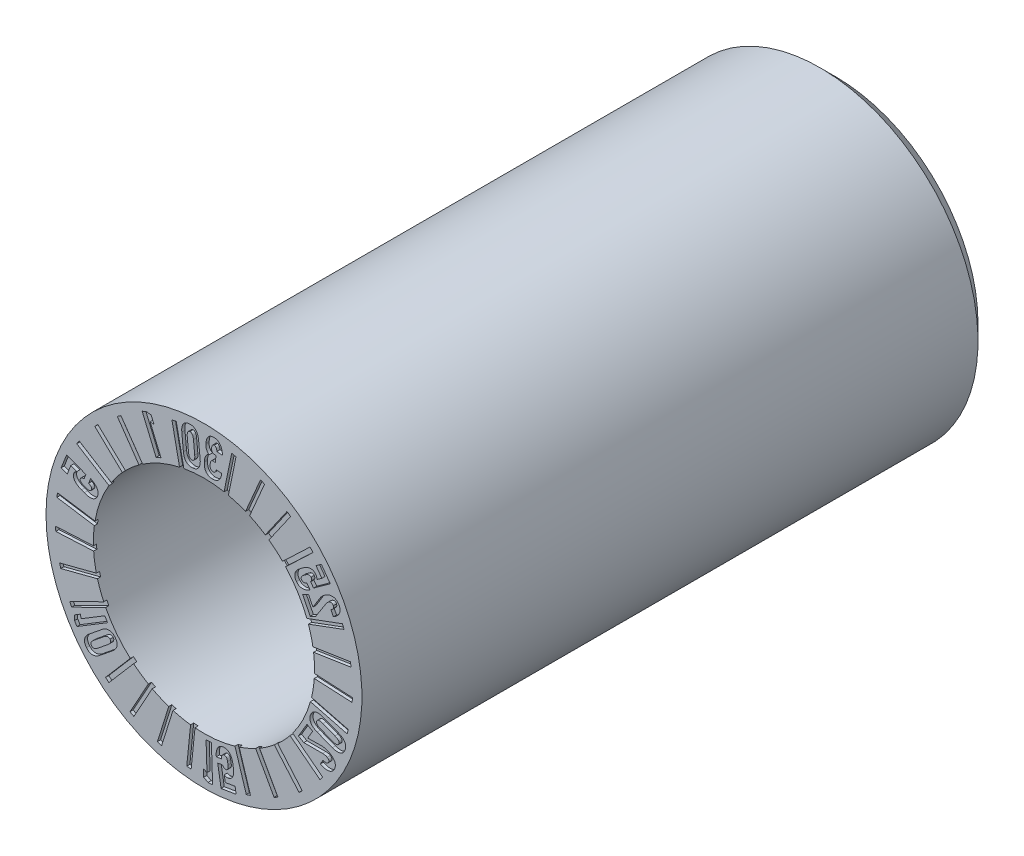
from build123d import *

# Parameters (mm, degrees)
CUT_EXTRUDE1_DEPTH = 0.1


with BuildPart() as part:
    # Sketch1 → Revolve1 (revolve)
    with BuildSketch(Plane(origin=(0, 0, 0), x_dir=(0, 0, -1), z_dir=(1, 0, 0)), mode=Mode.PRIVATE) as revolve1_sk:
        Polygon((20, 2.5), (20, 4.5), (19.5, 5), (0, 5), (0, 3.5), (5, 3.5), (5, 1.25), (15, 1.25), (15, 2.5), align=None)
    revolve(revolve1_sk.sketch.rotate(Axis((0, 0, 0), (0, 0, 1)), 90), axis=Axis((0, 0, 0), (0, 0, 1)))

    # Sketch2 → Cut-Extrude1 (cut)
    # profile 1 of 36: a face of its own
    with BuildSketch(Plane.XY):
        Polygon((1.01467014, 4.589699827), (0.71272236, 3.120404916), (0.575588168, 3.148586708), (0.877535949, 4.61788162), align=None)
    # profile 2 of 36: a face of its own
    with BuildSketch(Plane.XY):
        Polygon((1.917799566, 4.291496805), (1.326265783, 2.913060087), (1.19761169, 2.968269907), (1.789145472, 4.346706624), align=None)
    # profile 3 of 36: a face of its own
    with BuildSketch(Plane.XY):
        Polygon((2.742414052, 3.817599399), (1.885511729, 2.586454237), (1.770604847, 2.666431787), (2.62750717, 3.897576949), align=None)
    # profile 4 of 36: a face of its own
    with BuildSketch(Plane.XY):
        Polygon((3.454753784, 3.187409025), (2.367564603, 2.153958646), (2.271109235, 2.255429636), (3.358298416, 3.288880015), align=None)
    # profile 5 of 36: a face of its own
    with BuildSketch(Plane.XY):
        Polygon((4.431746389, 1.566692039), (3.025118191, 1.04573416), (2.976495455, 1.177019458), (4.383123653, 1.697977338), align=None)
    # profile 6 of 36: a face of its own
    with BuildSketch(Plane.XY):
        Polygon((4.656401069, 0.642517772), (3.173698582, 0.415376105), (3.152498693, 0.553761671), (4.63520118, 0.780903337), align=None)
    # profile 7 of 36: a face of its own
    with BuildSketch(Plane.XY):
        Polygon((4.690422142, -0.307961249), (3.192347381, -0.231987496), (3.199438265, -0.092167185), (4.697513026, -0.168140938), align=None)
    # profile 8 of 36: a face of its own
    with BuildSketch(Plane.XY):
        Polygon((4.532416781, -1.2458323), (3.080301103, -0.869853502), (3.115392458, -0.734322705), (4.567508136, -1.110301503), align=None)
    # profile 9 of 36: a face of its own
    with BuildSketch(Plane.XY):
        Polygon((3.673798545, -2.93225242), (2.487634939, -2.014093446), (2.573329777, -1.903384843), (3.759493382, -2.821543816), align=None)
    # profile 10 of 36: a face of its own
    with BuildSketch(Plane.XY):
        Polygon((3.0083376, -3.61175925), (2.031278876, -2.473622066), (2.137505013, -2.382429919), (3.114563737, -3.520567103), align=None)
    # profile 11 of 36: a face of its own
    with BuildSketch(Plane.XY):
        Polygon((2.219714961, -4.143400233), (1.491762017, -2.831880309), (1.614170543, -2.763938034), (2.342123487, -4.075457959), align=None)
    # profile 12 of 36: a face of its own
    with BuildSketch(Plane.XY):
        Polygon((1.34021693, -4.505409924), (0.891172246, -3.074201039), (1.024751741, -3.032290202), (1.473796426, -4.463499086), align=None)
    # profile 13 of 36: a face of its own
    with BuildSketch(Plane.XY):
        Polygon((-0.545131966, -4.668804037), (-0.393379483, -3.176500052), (-0.254097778, -3.190663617), (-0.405850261, -4.682967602), align=None)
    # profile 14 of 36: a face of its own
    with BuildSketch(Plane.XY):
        Polygon((-1.473796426, -4.463499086), (-1.024751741, -3.032290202), (-0.891172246, -3.074201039), (-1.34021693, -4.505409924), align=None)
    # profile 15 of 36: a face of its own
    with BuildSketch(Plane.XY):
        Polygon((-2.342123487, -4.075457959), (-1.614170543, -2.763938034), (-1.491762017, -2.831880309), (-2.219714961, -4.143400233), align=None)
    # profile 16 of 36: a face of its own
    with BuildSketch(Plane.XY):
        Polygon((-3.114563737, -3.520567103), (-2.137505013, -2.382429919), (-2.031278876, -2.473622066), (-3.0083376, -3.61175925), align=None)
    # profile 17 of 36: a face of its own
    with BuildSketch(Plane.XY):
        Polygon((-4.250508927, -2.007006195), (-2.903802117, -1.346414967), (-2.842146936, -1.472107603), (-4.188853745, -2.13269883), align=None)
    # profile 18 of 36: a face of its own
    with BuildSketch(Plane.XY):
        Polygon((-4.567508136, -1.110301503), (-3.115392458, -0.734322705), (-3.080301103, -0.869853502), (-4.532416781, -1.2458323), align=None)
    # profile 19 of 36: a face of its own
    with BuildSketch(Plane.XY):
        Polygon((-4.697513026, -0.168140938), (-3.199438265, -0.092167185), (-3.192347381, -0.231987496), (-4.690422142, -0.307961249), align=None)
    # profile 20 of 36: a face of its own
    with BuildSketch(Plane.XY):
        Polygon((-4.63520118, 0.780903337), (-3.152498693, 0.553761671), (-3.173698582, 0.415376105), (-4.656401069, 0.642517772), align=None)
    # profile 21 of 36: a face of its own
    with BuildSketch(Plane.XY):
        Polygon((-3.95160053, 2.545535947), (-2.678634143, 1.752089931), (-2.752689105, 1.633279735), (-4.025655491, 2.426725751), align=None)
    # profile 22 of 36: a face of its own
    with BuildSketch(Plane.XY):
        Polygon((-3.358298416, 3.288880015), (-2.271109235, 2.255429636), (-2.367564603, 2.153958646), (-3.454753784, 3.187409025), align=None)
    # profile 23 of 36: a face of its own
    with BuildSketch(Plane.XY):
        Polygon((-2.62750717, 3.897576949), (-1.770604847, 2.666431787), (-1.885511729, 2.586454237), (-2.742414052, 3.817599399), align=None)
    # profile 24 of 36: a face of its own
    with BuildSketch(Plane.XY):
        Polygon((-0.877535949, 4.61788162), (-0.575588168, 3.148586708), (-0.71272236, 3.120404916), (-1.01467014, 4.589699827), align=None)
    # profile 25 of 36: a face of its own
    with BuildSketch(Plane.XY):
        with BuildLine():
            Line((3.537106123, 1.478969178), (3.861617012, 1.985097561))
            add(Edge.make_bspline(
                [(3.861617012, 1.985097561), (3.869126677, 1.996025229), (3.883959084, 2.017608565), (3.90992891, 2.045935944), (3.937353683, 2.069550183), (3.957432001, 2.081034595), (3.966924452, 2.086464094)],
                knots=[0, 0, 0, 0, 1.075777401, 2.124777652, 3.113448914, 4, 4, 4, 4], degree=3))
            Line((3.966924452, 2.086464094), (3.968318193, 2.087161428))
            add(Edge.make_bspline(
                [(3.968318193, 2.087161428), (3.975010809, 2.090259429), (3.987655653, 2.096112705), (4.007191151, 2.100725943), (4.025616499, 2.10191601), (4.042979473, 2.098956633), (4.05911621, 2.092401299), (4.073174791, 2.081484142), (4.085778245, 2.067416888), (4.092007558, 2.056030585), (4.095268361, 2.050070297)],
                knots=[0, 0, 0, 0, 1.174484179, 2.219038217, 3.184458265, 4.102169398, 5.007560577, 5.934630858, 6.918859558, 8, 8, 8, 8], degree=3))
            add(Edge.make_bspline(
                [(4.095268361, 2.050070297), (4.097954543, 2.043868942), (4.103179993, 2.031805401), (4.10512018, 2.012073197), (4.102254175, 1.992396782), (4.094381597, 1.97286076), (4.082118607, 1.953546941), (4.065220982, 1.934916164), (4.044021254, 1.91686602), (4.027669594, 1.906315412), (4.019060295, 1.900760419)],
                knots=[0, 0, 0, 0, 0.871270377, 1.694888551, 2.530222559, 3.426223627, 4.402940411, 5.480495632, 6.673457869, 8, 8, 8, 8], degree=3))
            Line((4.019060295, 1.900760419), (4.095721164, 1.745450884))
            add(Edge.make_bspline(
                [(4.095721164, 1.745450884), (4.11142617, 1.754543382), (4.140334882, 1.771625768), (4.179544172, 1.800837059), (4.214027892, 1.831312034), (4.243402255, 1.863323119), (4.267527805, 1.896583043), (4.286558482, 1.930509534), (4.299817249, 1.965403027), (4.307389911, 2.000865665), (4.309738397, 2.036650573), (4.306275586, 2.072398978), (4.296986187, 2.107906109), (4.286902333, 2.130459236), (4.28175134, 2.141979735)],
                knots=[0, 0, 0, 0, 1.278907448, 2.478786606, 3.605086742, 4.67400219, 5.680892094, 6.633839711, 7.538995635, 8.427109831, 9.3028697, 10.177470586, 11.069022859, 12, 12, 12, 12], degree=3))
            add(Edge.make_bspline(
                [(4.28175134, 2.141979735), (4.275314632, 2.153852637), (4.262859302, 2.176827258), (4.240166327, 2.20770025), (4.214826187, 2.233863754), (4.186839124, 2.255156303), (4.156704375, 2.271668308), (4.124380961, 2.283223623), (4.090019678, 2.289590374), (4.053839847, 2.290767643), (4.016096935, 2.287159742), (3.97703998, 2.278295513), (3.936426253, 2.264976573), (3.909910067, 2.252328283), (3.896163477, 2.245771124)],
                knots=[0, 0, 0, 0, 1.071364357, 2.073140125, 3.031460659, 3.953777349, 4.85463199, 5.749254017, 6.66768898, 7.61770878, 8.614490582, 9.669551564, 10.791842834, 12, 12, 12, 12], degree=3))
            add(Edge.make_bspline(
                [(3.896163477, 2.245771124), (3.883875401, 2.239500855), (3.860853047, 2.227504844), (3.828023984, 2.206263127), (3.796295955, 2.183065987), (3.766241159, 2.15754336), (3.738183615, 2.130462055), (3.712233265, 2.102220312), (3.688855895, 2.072846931), (3.675321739, 2.052051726), (3.668635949, 2.041779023)],
                knots=[0, 0, 0, 0, 1.008240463, 2.018746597, 3.038460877, 4.064474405, 5.083707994, 6.070496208, 7.046837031, 8, 8, 8, 8], degree=3))
            Line((3.668635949, 2.041779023), (3.448862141, 1.68506104))
            Line((3.448862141, 1.68506104), (3.31185902, 1.959349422))
            Line((3.31185902, 1.959349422), (3.125840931, 1.866510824))
            Line((3.125840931, 1.866510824), (3.363027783, 1.391988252))
            Line((3.363027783, 1.391988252), (3.537106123, 1.478969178))
        make_face()
    # profile 26 of 36: a face of its own
    with BuildSketch(Plane.XY):
        with BuildLine():
            add(Edge.make_bspline(
                [(2.925964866, 2.126838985), (2.933280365, 2.117615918), (2.947740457, 2.099385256), (2.973836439, 2.076383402), (3.003098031, 2.05803202), (3.035041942, 2.043897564), (3.069606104, 2.034592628), (3.106388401, 2.030718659), (3.145037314, 2.031751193), (3.185466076, 2.037780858), (3.227172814, 2.049049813), (3.269915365, 2.065086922), (3.313331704, 2.08625383), (3.341500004, 2.103582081), (3.355994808, 2.112498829)],
                knots=[0, 0, 0, 0, 0.885991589, 1.75128449, 2.606338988, 3.48042636, 4.374685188, 5.292761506, 6.258245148, 7.28149435, 8.366223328, 9.508414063, 10.717883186, 12, 12, 12, 12], degree=3))
            Line((3.355994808, 2.112498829), (3.257073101, 2.250550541))
            add(Edge.make_bspline(
                [(3.257073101, 2.250550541), (3.247787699, 2.245016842), (3.2314128, 2.235498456), (3.206388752, 2.225097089), (3.182661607, 2.218877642), (3.16035998, 2.216550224), (3.139713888, 2.218651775), (3.121261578, 2.225049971), (3.105097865, 2.235832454), (3.096930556, 2.245748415), (3.092723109, 2.250856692)],
                knots=[0, 0, 0, 0, 1.321316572, 2.507806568, 3.578164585, 4.561779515, 5.46339896, 6.305099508, 7.126859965, 8, 8, 8, 8], degree=3))
            add(Edge.make_bspline(
                [(3.092723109, 2.250856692), (3.088917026, 2.256794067), (3.081534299, 2.268310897), (3.076238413, 2.28806678), (3.075952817, 2.308402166), (3.081579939, 2.329052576), (3.091861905, 2.349867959), (3.107580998, 2.370097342), (3.127424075, 2.390546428), (3.143398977, 2.402607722), (3.151844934, 2.408984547)],
                knots=[0, 0, 0, 0, 0.888030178, 1.722527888, 2.550032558, 3.434051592, 4.404269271, 5.47042815, 6.66261131, 8, 8, 8, 8], degree=3))
            Line((3.151844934, 2.408984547), (3.22868963, 2.464815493))
            add(Edge.make_bspline(
                [(3.22868963, 2.464815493), (3.237385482, 2.470864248), (3.25377586, 2.482265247), (3.278933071, 2.49521709), (3.302428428, 2.504131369), (3.324521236, 2.508501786), (3.34490082, 2.508333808), (3.363113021, 2.503217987), (3.379148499, 2.493636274), (3.38695073, 2.48404382), (3.390959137, 2.479115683)],
                knots=[0, 0, 0, 0, 1.39525182, 2.629840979, 3.72056481, 4.698400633, 5.583454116, 6.380437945, 7.167947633, 8, 8, 8, 8], degree=3))
            add(Edge.make_bspline(
                [(3.390959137, 2.479115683), (3.394173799, 2.474245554), (3.400520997, 2.464629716), (3.406554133, 2.44857792), (3.409399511, 2.43187959), (3.408870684, 2.414779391), (3.405514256, 2.397527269), (3.39870942, 2.380482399), (3.389442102, 2.363391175), (3.380890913, 2.353064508), (3.376475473, 2.347732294)],
                knots=[0, 0, 0, 0, 0.973030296, 1.921202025, 2.841845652, 3.787894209, 4.765734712, 5.763843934, 6.845352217, 8, 8, 8, 8], degree=3))
            Line((3.376475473, 2.347732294), (3.469528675, 2.219412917))
            Line((3.469528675, 2.219412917), (3.997867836, 2.602598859))
            Line((3.997867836, 2.602598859), (3.713963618, 2.993990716))
            Line((3.713963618, 2.993990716), (3.547185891, 2.8729116))
            Line((3.547185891, 2.8729116), (3.731438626, 2.618831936))
            Line((3.731438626, 2.618831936), (3.569193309, 2.501162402))
            add(Edge.make_bspline(
                [(3.569193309, 2.501162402), (3.570235, 2.506144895), (3.572347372, 2.516248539), (3.572858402, 2.532132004), (3.571709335, 2.548620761), (3.568307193, 2.565502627), (3.56348463, 2.582109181), (3.557256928, 2.598056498), (3.549830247, 2.613016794), (3.543547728, 2.6221096), (3.540443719, 2.62660209)],
                knots=[0, 0, 0, 0, 0.921008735, 1.867648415, 2.868505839, 3.911388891, 4.981955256, 5.999114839, 7.01142107, 8, 8, 8, 8], degree=3))
            add(Edge.make_bspline(
                [(3.540443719, 2.62660209), (3.53346811, 2.635534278), (3.519889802, 2.652921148), (3.494718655, 2.673768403), (3.46739984, 2.690152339), (3.437135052, 2.700724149), (3.40479823, 2.70660837), (3.370242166, 2.707068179), (3.333835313, 2.701952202), (3.295540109, 2.692024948), (3.255695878, 2.676845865), (3.214224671, 2.657059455), (3.171562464, 2.631898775), (3.143557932, 2.612292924), (3.129038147, 2.602127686)],
                knots=[0, 0, 0, 0, 0.879918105, 1.712796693, 2.527522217, 3.347738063, 4.193476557, 5.076363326, 6.025485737, 7.047293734, 8.149764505, 9.339436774, 10.62055163, 12, 12, 12, 12], degree=3))
            Line((3.129038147, 2.602127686), (3.05219345, 2.54629674))
            add(Edge.make_bspline(
                [(3.05219345, 2.54629674), (3.0379867, 2.535646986), (3.01059512, 2.515113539), (2.974497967, 2.48104327), (2.943002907, 2.447046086), (2.917845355, 2.411693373), (2.898042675, 2.375994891), (2.884303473, 2.339921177), (2.875939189, 2.303616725), (2.873992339, 2.267235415), (2.877684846, 2.230905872), (2.887946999, 2.195299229), (2.903653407, 2.159916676), (2.918355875, 2.138119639), (2.925964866, 2.126838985)],
                knots=[0, 0, 0, 0, 1.289634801, 2.486503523, 3.602778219, 4.653209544, 5.63252728, 6.562450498, 7.450272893, 8.329613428, 9.198969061, 10.092022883, 11.012561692, 12, 12, 12, 12], degree=3))
        make_face()
    # profile 27 of 36: a face of its own
    with BuildSketch(Plane.XY):
        with BuildLine():
            add(Edge.make_bspline(
                [(0.253969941, 3.608582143), (0.267250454, 3.60811704), (0.293252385, 3.607206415), (0.331475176, 3.611619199), (0.367743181, 3.621061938), (0.401893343, 3.635309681), (0.433670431, 3.65428924), (0.462549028, 3.678047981), (0.488328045, 3.706460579), (0.511289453, 3.7390369), (0.530301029, 3.775977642), (0.545892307, 3.816565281), (0.557195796, 3.860973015), (0.561335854, 3.892022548), (0.563466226, 3.907999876)],
                knots=[0, 0, 0, 0, 0.991673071, 1.941597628, 2.862324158, 3.783050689, 4.696478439, 5.617622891, 6.565995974, 7.554356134, 8.586381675, 9.661310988, 10.796567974, 12, 12, 12, 12], degree=3))
            Line((0.563466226, 3.907999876), (0.388761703, 3.920095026))
            add(Edge.make_bspline(
                [(0.388761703, 3.920095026), (0.387573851, 3.914469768), (0.385270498, 3.903561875), (0.380918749, 3.887946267), (0.375109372, 3.873857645), (0.366588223, 3.857429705), (0.353345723, 3.840258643), (0.337003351, 3.827421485), (0.322742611, 3.820236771), (0.311185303, 3.817510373), (0.29921021, 3.815196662), (0.291002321, 3.815611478), (0.286773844, 3.81582518)],
                knots=[0, 0, 0, 0, 1.071089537, 2.076941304, 3.014685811, 3.904600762, 5.520471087, 7.010002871, 7.738236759, 8.475136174, 9.214432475, 10, 10, 10, 10], degree=3))
            add(Edge.make_bspline(
                [(0.286773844, 3.81582518), (0.2792253, 3.816792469), (0.264711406, 3.818652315), (0.244514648, 3.826369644), (0.227608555, 3.83873398), (0.213958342, 3.855010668), (0.203729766, 3.874994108), (0.19685458, 3.898179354), (0.194127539, 3.924651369), (0.194777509, 3.943125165), (0.195120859, 3.95288404)],
                knots=[0, 0, 0, 0, 0.977717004, 1.87989668, 2.749810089, 3.64668343, 4.590292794, 5.621084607, 6.743326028, 8, 8, 8, 8], degree=3))
            Line((0.195120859, 3.95288404), (0.1969595, 3.979602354))
            add(Edge.make_bspline(
                [(0.1969595, 3.979602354), (0.197841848, 3.9897971), (0.199514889, 4.009127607), (0.205210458, 4.036020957), (0.213563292, 4.059027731), (0.223973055, 4.078224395), (0.236917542, 4.093319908), (0.252192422, 4.103953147), (0.269723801, 4.109894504), (0.281976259, 4.109802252), (0.288238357, 4.109755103)],
                knots=[0, 0, 0, 0, 1.380249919, 2.617125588, 3.69749369, 4.673757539, 5.549203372, 6.355606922, 7.159568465, 8, 8, 8, 8], degree=3))
            Line((0.288238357, 4.109755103), (0.364187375, 4.104354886))
            Line((0.364187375, 4.104354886), (0.37819874, 4.311396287))
            Line((0.37819874, 4.311396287), (0.302249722, 4.316796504))
            add(Edge.make_bspline(
                [(0.302249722, 4.316796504), (0.297145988, 4.317509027), (0.287208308, 4.318896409), (0.273733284, 4.32606611), (0.262664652, 4.336938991), (0.254120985, 4.351496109), (0.247795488, 4.369195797), (0.243715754, 4.38983963), (0.242112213, 4.413397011), (0.242830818, 4.429960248), (0.243212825, 4.438765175)],
                knots=[0, 0, 0, 0, 0.815235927, 1.587377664, 2.381454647, 3.257625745, 4.250509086, 5.361869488, 6.597584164, 8, 8, 8, 8], degree=3))
            Line((0.243212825, 4.438765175), (0.244551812, 4.458516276))
            add(Edge.make_bspline(
                [(0.244551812, 4.458516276), (0.245346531, 4.46677295), (0.246849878, 4.482391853), (0.251916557, 4.504094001), (0.259086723, 4.522808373), (0.268668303, 4.538251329), (0.280348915, 4.550434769), (0.293948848, 4.558973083), (0.309565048, 4.563401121), (0.320360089, 4.56333502), (0.325970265, 4.563300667)],
                knots=[0, 0, 0, 0, 1.333788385, 2.523087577, 3.575023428, 4.545628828, 5.428050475, 6.269011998, 7.100406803, 8, 8, 8, 8], degree=3))
            add(Edge.make_bspline(
                [(0.325970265, 4.563300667), (0.329733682, 4.562802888), (0.337158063, 4.56182088), (0.348029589, 4.55856717), (0.357793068, 4.552628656), (0.367251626, 4.545601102), (0.37557423, 4.536441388), (0.383397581, 4.525967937), (0.390042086, 4.513666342), (0.395889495, 4.499890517), (0.400703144, 4.484649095), (0.404862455, 4.467994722), (0.407574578, 4.449820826), (0.408731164, 4.43718823), (0.409327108, 4.430679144)],
                knots=[0, 0, 0, 0, 0.800989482, 1.580173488, 2.372276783, 3.199352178, 4.059514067, 4.972548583, 5.953147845, 7.001416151, 8.127090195, 9.322836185, 10.620561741, 12, 12, 12, 12], degree=3))
            Line((0.409327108, 4.430679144), (0.583373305, 4.418910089))
            add(Edge.make_bspline(
                [(0.583373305, 4.418910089), (0.582992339, 4.435838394), (0.582253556, 4.468666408), (0.575953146, 4.516195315), (0.566372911, 4.560476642), (0.552534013, 4.601239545), (0.535136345, 4.638247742), (0.514783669, 4.671342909), (0.490866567, 4.699917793), (0.464172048, 4.724098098), (0.434857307, 4.743978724), (0.403032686, 4.75828939), (0.369396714, 4.768584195), (0.34604273, 4.771063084), (0.334158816, 4.772324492)],
                knots=[0, 0, 0, 0, 1.27230578, 2.467303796, 3.59858345, 4.674031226, 5.696322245, 6.667733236, 7.586997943, 8.48816013, 9.368367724, 10.23784044, 11.103307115, 12, 12, 12, 12], degree=3))
            add(Edge.make_bspline(
                [(0.334158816, 4.772324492), (0.324496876, 4.772770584), (0.305663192, 4.773640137), (0.278037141, 4.771612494), (0.251803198, 4.767822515), (0.227262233, 4.76066892), (0.204081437, 4.751529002), (0.182701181, 4.739301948), (0.162645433, 4.724884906), (0.14435231, 4.707798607), (0.127529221, 4.688600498), (0.112838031, 4.666952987), (0.099793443, 4.643285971), (0.089091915, 4.617282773), (0.079996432, 4.589221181), (0.072801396, 4.559090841), (0.0676312, 4.526725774), (0.065721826, 4.504409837), (0.064737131, 4.492901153)],
                knots=[0, 0, 0, 0, 1.052085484, 2.050793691, 3.010965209, 3.932068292, 4.827223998, 5.717562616, 6.606023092, 7.51065746, 8.436686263, 9.379300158, 10.353253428, 11.373717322, 12.435487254, 13.562153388, 14.742763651, 16, 16, 16, 16], degree=3))
            Line((0.064737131, 4.492901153), (0.062302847, 4.458525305))
            add(Edge.make_bspline(
                [(0.062302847, 4.458525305), (0.061802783, 4.445731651), (0.060826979, 4.420766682), (0.064165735, 4.384228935), (0.072005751, 4.35004398), (0.083406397, 4.3182551), (0.098920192, 4.289428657), (0.118233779, 4.263914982), (0.140971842, 4.241616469), (0.158744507, 4.230104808), (0.167658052, 4.224331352)],
                knots=[0, 0, 0, 0, 1.133679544, 2.212212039, 3.239405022, 4.233969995, 5.196048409, 6.127643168, 7.060954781, 8, 8, 8, 8], degree=3))
            add(Edge.make_bspline(
                [(0.167658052, 4.224331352), (0.16225609, 4.223019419), (0.151489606, 4.220404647), (0.13620253, 4.214178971), (0.121555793, 4.206783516), (0.107782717, 4.197650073), (0.095106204, 4.186613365), (0.08290023, 4.174369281), (0.071628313, 4.160451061), (0.057593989, 4.139366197), (0.042396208, 4.109485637), (0.028465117, 4.069234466), (0.018702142, 4.024124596), (0.015871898, 3.992270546), (0.014396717, 3.975667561)],
                knots=[0, 0, 0, 0, 0.637174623, 1.269933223, 1.888808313, 2.518375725, 3.160489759, 3.814608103, 4.500497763, 5.211993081, 6.718565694, 8.332560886, 10.088455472, 12, 12, 12, 12], degree=3))
            Line((0.014396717, 3.975667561), (0.011962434, 3.941291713))
            add(Edge.make_bspline(
                [(0.011962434, 3.941291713), (0.011240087, 3.925248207), (0.009845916, 3.894283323), (0.012520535, 3.849250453), (0.019339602, 3.807564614), (0.030029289, 3.769224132), (0.045139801, 3.73468592), (0.0638103, 3.703715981), (0.08700707, 3.677119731), (0.113671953, 3.654381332), (0.143996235, 3.63601754), (0.177767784, 3.622265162), (0.214683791, 3.612493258), (0.24061989, 3.609911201), (0.253969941, 3.608582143)],
                knots=[0, 0, 0, 0, 1.238278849, 2.389949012, 3.472617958, 4.491643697, 5.451665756, 6.372602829, 7.270087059, 8.161706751, 9.066142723, 9.992026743, 10.966438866, 12, 12, 12, 12], degree=3))
        make_face()
    # profile 28 of 36: a face of its own
    with BuildSketch(Plane.XY):
        with BuildLine():
            add(Edge.make_bspline(
                [(-0.35407824, 3.599473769), (-0.343590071, 3.600706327), (-0.323163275, 3.60310686), (-0.293921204, 3.610395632), (-0.266682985, 3.619360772), (-0.241701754, 3.631326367), (-0.21907307, 3.645863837), (-0.198355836, 3.662525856), (-0.180360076, 3.682114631), (-0.164270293, 3.703767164), (-0.150606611, 3.727750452), (-0.139077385, 3.753572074), (-0.130271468, 3.781338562), (-0.123535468, 3.810807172), (-0.119175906, 3.842133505), (-0.117133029, 3.875342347), (-0.117169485, 3.910380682), (-0.119206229, 3.934238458), (-0.120249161, 3.94645504)],
                knots=[0, 0, 0, 0, 1.065437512, 2.075049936, 3.03733099, 3.957271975, 4.863514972, 5.748623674, 6.634112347, 7.542108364, 8.467617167, 9.415844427, 10.392697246, 11.404337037, 12.465431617, 13.582789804, 14.762246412, 16, 16, 16, 16], degree=3))
            Line((-0.120249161, 3.94645504), (-0.17088256, 4.45993212))
            add(Edge.make_bspline(
                [(-0.17088256, 4.45993212), (-0.172346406, 4.472266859), (-0.175188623, 4.496216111), (-0.181522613, 4.530887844), (-0.190126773, 4.563140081), (-0.200565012, 4.593151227), (-0.212970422, 4.620885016), (-0.227233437, 4.64631724), (-0.243534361, 4.669327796), (-0.26164323, 4.689985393), (-0.281581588, 4.708071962), (-0.303328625, 4.723409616), (-0.326815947, 4.735774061), (-0.351806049, 4.745635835), (-0.3786051, 4.752116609), (-0.406926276, 4.755842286), (-0.436904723, 4.757110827), (-0.457295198, 4.755536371), (-0.46775279, 4.754728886)],
                knots=[0, 0, 0, 0, 1.253963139, 2.43470751, 3.555010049, 4.620952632, 5.639501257, 6.618633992, 7.560176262, 8.481503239, 9.386933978, 10.271808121, 11.160817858, 12.060932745, 12.977303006, 13.936694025, 14.941799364, 16, 16, 16, 16], degree=3))
            add(Edge.make_bspline(
                [(-0.46775279, 4.754728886), (-0.478230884, 4.753458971), (-0.498635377, 4.750986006), (-0.528024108, 4.744211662), (-0.555058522, 4.734688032), (-0.580124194, 4.723205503), (-0.602662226, 4.708778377), (-0.62337932, 4.69234025), (-0.641649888, 4.673166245), (-0.65753431, 4.651537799), (-0.671272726, 4.627880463), (-0.682909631, 4.602225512), (-0.691623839, 4.574392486), (-0.698641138, 4.544806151), (-0.702838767, 4.513201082), (-0.704972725, 4.479784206), (-0.704436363, 4.444375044), (-0.702552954, 4.420208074), (-0.70158187, 4.407747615)],
                knots=[0, 0, 0, 0, 1.064142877, 2.072256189, 3.034414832, 3.951343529, 4.846385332, 5.726787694, 6.613061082, 7.508920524, 8.427444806, 9.368152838, 10.343818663, 11.364562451, 12.431739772, 13.555286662, 14.739508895, 16, 16, 16, 16], degree=3))
            Line((-0.70158187, 4.407747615), (-0.650948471, 3.894270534))
            add(Edge.make_bspline(
                [(-0.650948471, 3.894270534), (-0.649485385, 3.881935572), (-0.646644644, 3.857985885), (-0.640286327, 3.823241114), (-0.631690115, 3.790905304), (-0.621209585, 3.760829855), (-0.608880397, 3.733135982), (-0.594468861, 3.70779678), (-0.578328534, 3.684679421), (-0.560134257, 3.66399532), (-0.540205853, 3.645899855), (-0.518545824, 3.630634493), (-0.495202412, 3.618293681), (-0.47012682, 3.608802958), (-0.443412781, 3.602085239), (-0.41505891, 3.598297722), (-0.38507706, 3.597041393), (-0.364611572, 3.598647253), (-0.35407824, 3.599473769)],
                knots=[0, 0, 0, 0, 1.253719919, 2.434235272, 3.562122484, 4.627858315, 5.646209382, 6.617726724, 7.566232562, 8.487380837, 9.392635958, 10.277338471, 11.155176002, 12.050930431, 12.977535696, 13.929353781, 14.934264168, 16, 16, 16, 16], degree=3))
        make_face()
        with BuildLine():
            add(Edge.make_bspline(
                [(-0.374286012, 3.804636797), (-0.382332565, 3.804299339), (-0.397691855, 3.803655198), (-0.419680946, 3.810342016), (-0.43866075, 3.822795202), (-0.454147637, 3.841449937), (-0.467082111, 3.865068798), (-0.476918, 3.893969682), (-0.484887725, 3.927698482), (-0.487769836, 3.952048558), (-0.489302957, 3.965001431)],
                knots=[0, 0, 0, 0, 0.866978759, 1.654892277, 2.443698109, 3.292597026, 4.252785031, 5.346417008, 6.588442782, 8, 8, 8, 8], degree=3))
            Line((-0.489302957, 3.965001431), (-0.529079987, 4.369769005))
            add(Edge.make_bspline(
                [(-0.529079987, 4.369769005), (-0.530123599, 4.382715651), (-0.532088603, 4.407092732), (-0.530843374, 4.441682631), (-0.526906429, 4.471970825), (-0.518764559, 4.497764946), (-0.507098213, 4.519025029), (-0.491134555, 4.53534881), (-0.470613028, 4.54575908), (-0.455448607, 4.548261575), (-0.447545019, 4.549565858)],
                knots=[0, 0, 0, 0, 1.404942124, 2.645348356, 3.740500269, 4.701344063, 5.557028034, 6.342926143, 7.13634498, 8, 8, 8, 8], degree=3))
            add(Edge.make_bspline(
                [(-0.447545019, 4.549565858), (-0.439501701, 4.549898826), (-0.424148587, 4.550534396), (-0.402063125, 4.543891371), (-0.383213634, 4.531155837), (-0.367578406, 4.512595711), (-0.355008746, 4.488787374), (-0.34506885, 4.45997585), (-0.337146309, 4.426301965), (-0.334277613, 4.402030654), (-0.332755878, 4.389155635)],
                knots=[0, 0, 0, 0, 0.867520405, 1.655926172, 2.45113691, 3.300566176, 4.25882156, 5.353136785, 6.595938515, 8, 8, 8, 8], degree=3))
            Line((-0.332755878, 4.389155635), (-0.292978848, 3.984388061))
            add(Edge.make_bspline(
                [(-0.292978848, 3.984388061), (-0.291952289, 3.971443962), (-0.290013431, 3.946996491), (-0.291059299, 3.912372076), (-0.295350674, 3.882140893), (-0.302830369, 3.856228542), (-0.314836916, 3.835164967), (-0.330680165, 3.818846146), (-0.351222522, 3.808445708), (-0.366383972, 3.80594181), (-0.374286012, 3.804636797)],
                knots=[0, 0, 0, 0, 1.405425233, 2.654421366, 3.742057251, 4.70651852, 5.556187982, 6.342356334, 7.136047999, 8, 8, 8, 8], degree=3))
        make_face(mode=Mode.SUBTRACT)
    # profile 29 of 36: a face of its own
    with BuildSketch(Plane.XY):
        Polygon((-1.516486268, 3.310170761), (-1.361075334, 3.375394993), (-1.703603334, 4.189535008), (-1.583267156, 4.183505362), (-1.67119073, 4.392843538), (-1.823889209, 4.411605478), (-1.956420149, 4.355871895), align=None)
    # profile 30 of 36: a face of its own
    with BuildSketch(Plane.XY):
        with BuildLine():
            add(Edge.make_bspline(
                [(-3.366609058, 1.322492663), (-3.362796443, 1.333648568), (-3.355298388, 1.355588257), (-3.349751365, 1.389862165), (-3.350466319, 1.424223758), (-3.355593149, 1.458622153), (-3.366798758, 1.492466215), (-3.383065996, 1.525466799), (-3.404797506, 1.55742413), (-3.431852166, 1.587996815), (-3.463601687, 1.617350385), (-3.500515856, 1.644167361), (-3.541517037, 1.669632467), (-3.571390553, 1.683869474), (-3.586775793, 1.691201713)],
                knots=[0, 0, 0, 0, 0.889190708, 1.748721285, 2.604844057, 3.475146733, 4.365106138, 5.284915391, 6.245170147, 7.273843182, 8.361453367, 9.503096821, 10.714063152, 12, 12, 12, 12], degree=3))
            Line((-3.586775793, 1.691201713), (-3.649043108, 1.534287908))
            add(Edge.make_bspline(
                [(-3.649043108, 1.534287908), (-3.639605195, 1.529380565), (-3.622937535, 1.52063278), (-3.600759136, 1.505310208), (-3.582818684, 1.488745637), (-3.568836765, 1.471244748), (-3.559443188, 1.452779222), (-3.55472533, 1.433762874), (-3.554953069, 1.414393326), (-3.55878742, 1.402161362), (-3.560744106, 1.395919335)],
                knots=[0, 0, 0, 0, 1.315819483, 2.500908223, 3.571548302, 4.551485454, 5.463590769, 6.303028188, 7.134027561, 8, 8, 8, 8], degree=3))
            add(Edge.make_bspline(
                [(-3.560744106, 1.395919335), (-3.563746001, 1.389608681), (-3.569584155, 1.37733558), (-3.583002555, 1.361956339), (-3.600408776, 1.351550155), (-3.620528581, 1.344850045), (-3.643540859, 1.342691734), (-3.669018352, 1.344334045), (-3.696808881, 1.350709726), (-3.7156074, 1.357502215), (-3.725521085, 1.361084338)],
                knots=[0, 0, 0, 0, 0.88503002, 1.721226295, 2.54671211, 3.431304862, 4.39351618, 5.462627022, 6.661877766, 8, 8, 8, 8], degree=3))
            Line((-3.725521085, 1.361084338), (-3.814054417, 1.395884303))
            add(Edge.make_bspline(
                [(-3.814054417, 1.395884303), (-3.823855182, 1.399904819), (-3.842339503, 1.407487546), (-3.866746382, 1.421752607), (-3.887127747, 1.436539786), (-3.902442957, 1.453009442), (-3.913447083, 1.470100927), (-3.918861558, 1.488131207), (-3.919676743, 1.506671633), (-3.915808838, 1.518343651), (-3.913832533, 1.524307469)],
                knots=[0, 0, 0, 0, 1.398118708, 2.636863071, 3.72742474, 4.712435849, 5.593813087, 6.387146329, 7.175912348, 8, 8, 8, 8], degree=3))
            add(Edge.make_bspline(
                [(-3.913832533, 1.524307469), (-3.911427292, 1.529716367), (-3.906768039, 1.540194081), (-3.896486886, 1.553950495), (-3.884028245, 1.56531764), (-3.869328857, 1.574101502), (-3.852850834, 1.580311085), (-3.834828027, 1.583854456), (-3.815355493, 1.584694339), (-3.802120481, 1.583231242), (-3.79526071, 1.582472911)],
                knots=[0, 0, 0, 0, 0.986961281, 1.911867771, 2.847133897, 3.789539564, 4.756345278, 5.776616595, 6.847609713, 8, 8, 8, 8], degree=3))
            Line((-3.79526071, 1.582472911), (-3.737395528, 1.729201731))
            Line((-3.737395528, 1.729201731), (-4.344621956, 1.967825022))
            Line((-4.344621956, 1.967825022), (-4.52073194, 1.519822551))
            Line((-4.52073194, 1.519822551), (-4.328994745, 1.44450177))
            Line((-4.328994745, 1.44450177), (-4.214653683, 1.735443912))
            Line((-4.214653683, 1.735443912), (-4.028082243, 1.662075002))
            add(Edge.make_bspline(
                [(-4.028082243, 1.662075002), (-4.032850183, 1.660354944), (-4.042583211, 1.656843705), (-4.056148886, 1.648678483), (-4.069484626, 1.639010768), (-4.081831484, 1.627168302), (-4.093344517, 1.6142866), (-4.103223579, 1.600372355), (-4.112032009, 1.58618571), (-4.1162503, 1.575975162), (-4.11834832, 1.570896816)],
                knots=[0, 0, 0, 0, 0.918667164, 1.875320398, 2.863013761, 3.906338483, 4.97579368, 5.996493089, 7.003530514, 8, 8, 8, 8], degree=3))
            add(Edge.make_bspline(
                [(-4.11834832, 1.570896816), (-4.121988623, 1.560299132), (-4.129103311, 1.53958679), (-4.133646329, 1.507405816), (-4.132137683, 1.47571251), (-4.12496563, 1.444589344), (-4.112161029, 1.414353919), (-4.094058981, 1.384963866), (-4.070181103, 1.357083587), (-4.041168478, 1.330283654), (-4.00703964, 1.304692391), (-3.967755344, 1.280817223), (-3.92370145, 1.258270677), (-3.892163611, 1.245247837), (-3.875811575, 1.238495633)],
                knots=[0, 0, 0, 0, 0.872723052, 1.705668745, 2.517355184, 3.335044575, 4.184004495, 5.067802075, 6.017198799, 7.038167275, 8.143646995, 9.339094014, 10.620348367, 12, 12, 12, 12], degree=3))
            Line((-3.875811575, 1.238495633), (-3.787278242, 1.203695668))
            add(Edge.make_bspline(
                [(-3.787278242, 1.203695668), (-3.770724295, 1.197542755), (-3.738672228, 1.18562937), (-3.69074164, 1.173004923), (-3.645041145, 1.165599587), (-3.60180854, 1.163033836), (-3.561089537, 1.165387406), (-3.523265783, 1.173252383), (-3.488252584, 1.185713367), (-3.456601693, 1.203742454), (-3.42805214, 1.226220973), (-3.403551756, 1.253982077), (-3.382376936, 1.2861279), (-3.371956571, 1.31015993), (-3.366609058, 1.322492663)],
                knots=[0, 0, 0, 0, 1.286097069, 2.490165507, 3.604308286, 4.65392713, 5.639723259, 6.566467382, 7.459700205, 8.335805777, 9.208726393, 10.094677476, 11.022228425, 12, 12, 12, 12], degree=3))
        make_face()
    # profile 31 of 36: a face of its own
    with BuildSketch(Plane.XY):
        Polygon((-3.04950393, -1.98903026), (-3.137914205, -1.843533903), (-3.894020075, -2.303461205), (-3.905997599, -2.182651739), (-4.100448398, -2.300906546), (-4.095816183, -2.455588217), (-4.020398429, -2.579700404), align=None)
    # profile 32 of 36: a face of its own
    with BuildSketch(Plane.XY):
        with BuildLine():
            add(Edge.make_bspline(
                [(-2.813201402, -2.272720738), (-2.820061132, -2.26465809), (-2.833431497, -2.248943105), (-2.855501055, -2.228315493), (-2.878225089, -2.210640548), (-2.901852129, -2.196126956), (-2.926572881, -2.185106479), (-2.952086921, -2.177235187), (-2.978457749, -2.172465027), (-3.005535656, -2.171307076), (-3.033101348, -2.173105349), (-3.061132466, -2.17753034), (-3.089319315, -2.185340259), (-3.117669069, -2.196114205), (-3.14641125, -2.20949204), (-3.17524197, -2.22621156), (-3.204549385, -2.245592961), (-3.223369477, -2.26045373), (-3.233031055, -2.26808273)],
                knots=[0, 0, 0, 0, 1.064799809, 2.075411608, 3.034193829, 3.95861605, 4.859066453, 5.751076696, 6.640221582, 7.548766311, 8.471708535, 9.416928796, 10.400052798, 11.409792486, 12.466774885, 13.587291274, 14.761399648, 16, 16, 16, 16], degree=3))
            Line((-3.233031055, -2.26808273), (-3.635679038, -2.593863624))
            add(Edge.make_bspline(
                [(-3.635679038, -2.593863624), (-3.645192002, -2.601877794), (-3.663707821, -2.617476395), (-3.689294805, -2.641900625), (-3.711641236, -2.666916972), (-3.730914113, -2.692370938), (-3.747551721, -2.717947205), (-3.760725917, -2.744148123), (-3.771343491, -2.770395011), (-3.778444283, -2.797104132), (-3.782570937, -2.823798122), (-3.78354968, -2.850498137), (-3.781170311, -2.876991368), (-3.775195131, -2.903287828), (-3.765870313, -2.929321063), (-3.753661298, -2.955355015), (-3.73775315, -2.980942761), (-3.72529604, -2.9972352), (-3.718895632, -3.005606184)],
                knots=[0, 0, 0, 0, 1.250485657, 2.433917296, 3.553241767, 4.619132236, 5.64162298, 6.616147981, 7.563384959, 8.483348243, 9.388195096, 10.274048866, 11.16307928, 12.054935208, 12.97769499, 13.938562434, 14.940842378, 16, 16, 16, 16], degree=3))
            add(Edge.make_bspline(
                [(-3.718895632, -3.005606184), (-3.712070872, -3.013763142), (-3.698796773, -3.029628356), (-3.676559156, -3.050185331), (-3.654052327, -3.068196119), (-3.630288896, -3.082596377), (-3.605758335, -3.093848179), (-3.580459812, -3.102048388), (-3.554295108, -3.106519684), (-3.527474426, -3.108295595), (-3.499947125, -3.106782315), (-3.472095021, -3.101909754), (-3.443805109, -3.094399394), (-3.415407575, -3.083399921), (-3.386381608, -3.069879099), (-3.357276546, -3.052974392), (-3.327608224, -3.033349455), (-3.308506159, -3.018317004), (-3.29866049, -3.010568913)],
                knots=[0, 0, 0, 0, 1.066726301, 2.074773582, 3.03449852, 3.956574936, 4.856387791, 5.739108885, 6.618227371, 7.51437142, 8.43290087, 9.378571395, 10.3487269, 11.36665036, 12.431845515, 13.560497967, 14.742621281, 16, 16, 16, 16], degree=3))
            Line((-3.29866049, -3.010568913), (-2.896012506, -2.684788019))
            add(Edge.make_bspline(
                [(-2.896012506, -2.684788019), (-2.886489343, -2.676784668), (-2.867904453, -2.661165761), (-2.84241573, -2.636543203), (-2.820015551, -2.611502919), (-2.800715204, -2.586174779), (-2.784448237, -2.560477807), (-2.770817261, -2.534606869), (-2.76067029, -2.508156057), (-2.753439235, -2.4815079), (-2.749391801, -2.454806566), (-2.748232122, -2.428139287), (-2.751253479, -2.40173544), (-2.756572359, -2.375326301), (-2.766074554, -2.349280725), (-2.77832539, -2.323229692), (-2.794038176, -2.297376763), (-2.806697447, -2.281088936), (-2.813201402, -2.272720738)],
                knots=[0, 0, 0, 0, 1.24989822, 2.439233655, 3.558032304, 4.623422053, 5.635427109, 6.611513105, 7.557056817, 8.476587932, 9.381009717, 10.266447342, 11.150001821, 12.045303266, 12.967629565, 13.928045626, 14.935491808, 16, 16, 16, 16], degree=3))
        make_face()
        with BuildLine():
            add(Edge.make_bspline(
                [(-2.973984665, -2.402854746), (-2.969243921, -2.409419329), (-2.960175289, -2.421976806), (-2.953538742, -2.444200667), (-2.953546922, -2.467150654), (-2.960782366, -2.490465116), (-2.973689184, -2.51416921), (-2.992068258, -2.538639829), (-3.016246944, -2.56366991), (-3.035093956, -2.579494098), (-3.045097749, -2.587893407)],
                knots=[0, 0, 0, 0, 0.8672991, 1.659067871, 2.452768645, 3.305823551, 4.259376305, 5.349717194, 6.593258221, 8, 8, 8, 8], degree=3))
            Line((-3.045097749, -2.587893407), (-3.36233015, -2.844577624))
            add(Edge.make_bspline(
                [(-3.36233015, -2.844577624), (-3.372555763, -2.852644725), (-3.391822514, -2.867844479), (-3.421570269, -2.885696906), (-3.4490931, -2.89916709), (-3.47509003, -2.906731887), (-3.499454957, -2.908884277), (-3.52183817, -2.904043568), (-3.54229738, -2.893071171), (-3.552677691, -2.881519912), (-3.558112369, -2.875472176)],
                knots=[0, 0, 0, 0, 1.401975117, 2.64155365, 3.731346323, 4.694387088, 5.544856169, 6.337569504, 7.129623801, 8, 8, 8, 8], degree=3))
            add(Edge.make_bspline(
                [(-3.558112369, -2.875472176), (-3.56275937, -2.86891406), (-3.571677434, -2.856328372), (-3.5783274, -2.834247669), (-3.578291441, -2.81140761), (-3.571459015, -2.787944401), (-3.55814486, -2.764327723), (-3.539837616, -2.739714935), (-3.515618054, -2.71477543), (-3.496911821, -2.698864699), (-3.486999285, -2.690433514)],
                knots=[0, 0, 0, 0, 0.862451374, 1.655131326, 2.441580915, 3.2950863, 4.260059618, 5.35165529, 6.596627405, 8, 8, 8, 8], degree=3))
            Line((-3.486999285, -2.690433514), (-3.169766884, -2.433749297))
            add(Edge.make_bspline(
                [(-3.169766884, -2.433749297), (-3.159440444, -2.425738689), (-3.139977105, -2.410640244), (-3.110404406, -2.392374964), (-3.082702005, -2.379259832), (-3.056783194, -2.371623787), (-3.032424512, -2.369514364), (-3.009971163, -2.37426781), (-2.989779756, -2.385543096), (-2.979384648, -2.396936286), (-2.973984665, -2.402854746)],
                knots=[0, 0, 0, 0, 1.407964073, 2.653739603, 3.738899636, 4.702290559, 5.553068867, 6.346070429, 7.140827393, 8, 8, 8, 8], degree=3))
        make_face(mode=Mode.SUBTRACT)
    # profile 33 of 36: a face of its own
    with BuildSketch(Plane.XY):
        Polygon((0.235389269, -3.633363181), (0.06626129, -3.638994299), (0.09557747, -4.526699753), (-0.015488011, -4.477489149), (-0.007790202, -4.705852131), (0.128550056, -4.778066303), (0.273059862, -4.773369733), align=None)
    # profile 34 of 36: a face of its own
    with BuildSketch(Plane.XY):
        with BuildLine():
            add(Edge.make_bspline(
                [(0.594626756, -3.568043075), (0.583040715, -3.570482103), (0.560280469, -3.575273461), (0.528115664, -3.588415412), (0.498645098, -3.606181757), (0.472059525, -3.628757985), (0.448451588, -3.65550654), (0.428641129, -3.686609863), (0.412134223, -3.721490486), (0.399578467, -3.760307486), (0.390655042, -3.802503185), (0.386129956, -3.847816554), (0.385577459, -3.896076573), (0.388563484, -3.929032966), (0.390103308, -3.946027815)],
                knots=[0, 0, 0, 0, 0.892268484, 1.752820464, 2.608135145, 3.479812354, 4.375234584, 5.290900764, 6.254052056, 7.280522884, 8.363209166, 9.503490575, 10.712607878, 12, 12, 12, 12], degree=3))
            Line((0.390103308, -3.946027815), (0.557685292, -3.919086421))
            add(Edge.make_bspline(
                [(0.557685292, -3.919086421), (0.556822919, -3.908345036), (0.555754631, -3.889574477), (0.557504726, -3.862685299), (0.562660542, -3.838750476), (0.570658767, -3.8178129), (0.581622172, -3.80026113), (0.595479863, -3.786562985), (0.612036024, -3.776556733), (0.624575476, -3.773824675), (0.630980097, -3.772429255)],
                knots=[0, 0, 0, 0, 1.313509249, 2.499973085, 3.572531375, 4.559315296, 5.468440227, 6.30254304, 7.133010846, 8, 8, 8, 8], degree=3))
            add(Edge.make_bspline(
                [(0.630980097, -3.772429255), (0.63803731, -3.771562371), (0.651649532, -3.769890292), (0.671696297, -3.774314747), (0.689990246, -3.783176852), (0.706047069, -3.79732148), (0.720008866, -3.815824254), (0.731268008, -3.838734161), (0.740148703, -3.865819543), (0.743933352, -3.885448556), (0.745942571, -3.895869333)],
                knots=[0, 0, 0, 0, 0.893868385, 1.724127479, 2.555657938, 3.443056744, 4.403725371, 5.472250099, 6.658051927, 8, 8, 8, 8], degree=3))
            Line((0.745942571, -3.895869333), (0.761626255, -3.989707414))
            add(Edge.make_bspline(
                [(0.761626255, -3.989707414), (0.763168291, -4.000130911), (0.766084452, -4.019842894), (0.766319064, -4.048138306), (0.763794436, -4.073233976), (0.757802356, -4.094993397), (0.748533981, -4.11311496), (0.735786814, -4.126953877), (0.720267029, -4.137202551), (0.708214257, -4.139877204), (0.702036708, -4.141248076)],
                knots=[0, 0, 0, 0, 1.389369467, 2.627451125, 3.724862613, 4.708862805, 5.591184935, 6.382539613, 7.170983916, 8, 8, 8, 8], degree=3))
            add(Edge.make_bspline(
                [(0.702036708, -4.141248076), (0.69614577, -4.141941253), (0.684734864, -4.143283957), (0.667681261, -4.14145997), (0.651595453, -4.136531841), (0.636479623, -4.128522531), (0.62261132, -4.117638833), (0.610370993, -4.103944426), (0.599538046, -4.087722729), (0.594032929, -4.075540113), (0.591169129, -4.069202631)],
                knots=[0, 0, 0, 0, 0.988350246, 1.914461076, 2.840842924, 3.783431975, 4.755821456, 5.769912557, 6.839892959, 8, 8, 8, 8], degree=3))
            Line((0.591169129, -4.069202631), (0.43504029, -4.09516848))
            Line((0.43504029, -4.09516848), (0.541703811, -4.738615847))
            Line((0.541703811, -4.738615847), (1.018090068, -4.659697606))
            Line((1.018090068, -4.659697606), (0.984392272, -4.45661209))
            Line((0.984392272, -4.45661209), (0.675286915, -4.507709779))
            Line((0.675286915, -4.507709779), (0.6424412, -4.309980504))
            add(Edge.make_bspline(
                [(0.6424412, -4.309980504), (0.646359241, -4.313250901), (0.654286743, -4.319868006), (0.668307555, -4.327295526), (0.683496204, -4.333722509), (0.705410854, -4.339997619), (0.733703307, -4.343996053), (0.756163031, -4.341780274), (0.767149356, -4.340696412)],
                knots=[0, 0, 0, 0, 0.693009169, 1.402188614, 2.149002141, 2.935820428, 4.501135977, 6, 6, 6, 6], degree=3))
            add(Edge.make_bspline(
                [(0.767149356, -4.340696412), (0.778205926, -4.338380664), (0.799770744, -4.333864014), (0.829719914, -4.320997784), (0.856408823, -4.303677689), (0.879558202, -4.281580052), (0.898835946, -4.25492377), (0.914752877, -4.224305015), (0.926488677, -4.189450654), (0.934933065, -4.150790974), (0.939175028, -4.108322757), (0.939401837, -4.062449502), (0.936488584, -4.013119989), (0.931498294, -3.979397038), (0.928907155, -3.961886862)],
                knots=[0, 0, 0, 0, 0.878557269, 1.713544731, 2.522952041, 3.346543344, 4.191955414, 5.075534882, 6.025610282, 7.049200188, 8.153504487, 9.34455037, 10.62119445, 12, 12, 12, 12], degree=3))
            Line((0.928907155, -3.961886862), (0.913223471, -3.868048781))
            add(Edge.make_bspline(
                [(0.913223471, -3.868048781), (0.90997045, -3.850697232), (0.903673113, -3.817107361), (0.889797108, -3.76958106), (0.873068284, -3.726433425), (0.852921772, -3.68806203), (0.829615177, -3.654475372), (0.803754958, -3.625699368), (0.774744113, -3.602445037), (0.743359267, -3.584093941), (0.709141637, -3.571527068), (0.672738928, -3.564496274), (0.634104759, -3.562980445), (0.608059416, -3.566320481), (0.594626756, -3.568043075)],
                knots=[0, 0, 0, 0, 1.284146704, 2.485906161, 3.597327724, 4.647125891, 5.631837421, 6.565758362, 7.45230906, 8.327102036, 9.200277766, 10.091562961, 11.015740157, 12, 12, 12, 12], degree=3))
        make_face()
    # profile 35 of 36: a face of its own
    with BuildSketch(Plane.XY):
        with BuildLine():
            Line((3.158206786, -2.171871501), (3.757530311, -2.169656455))
            add(Edge.make_bspline(
                [(3.757530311, -2.169656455), (3.770718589, -2.169974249), (3.796824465, -2.170603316), (3.834555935, -2.177043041), (3.869292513, -2.187019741), (3.889761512, -2.197707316), (3.899478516, -2.202780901)],
                knots=[0, 0, 0, 0, 1.072893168, 2.123765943, 3.109317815, 4, 4, 4, 4], degree=3))
            Line((3.899478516, -2.202780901), (3.900760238, -2.203667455))
            add(Edge.make_bspline(
                [(3.900760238, -2.203667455), (3.906872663, -2.207626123), (3.91845995, -2.215130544), (3.933064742, -2.228666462), (3.943866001, -2.243593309), (3.950612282, -2.259820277), (3.953567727, -2.276936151), (3.95223145, -2.294579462), (3.947416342, -2.312820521), (3.941142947, -2.324169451), (3.937847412, -2.33013126)],
                knots=[0, 0, 0, 0, 1.165672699, 2.209758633, 3.17199013, 4.095831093, 5.002588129, 5.928843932, 6.911982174, 8, 8, 8, 8], degree=3))
            add(Edge.make_bspline(
                [(3.937847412, -2.33013126), (3.934091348, -2.335743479), (3.926813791, -2.346617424), (3.911469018, -2.359092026), (3.893398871, -2.367204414), (3.872773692, -2.371320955), (3.849984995, -2.371424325), (3.825323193, -2.367275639), (3.798842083, -2.359340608), (3.781159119, -2.351468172), (3.771837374, -2.347318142)],
                knots=[0, 0, 0, 0, 0.874940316, 1.695239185, 2.533905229, 3.42972409, 4.41263712, 5.483054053, 6.673167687, 8, 8, 8, 8], degree=3))
            Line((3.771837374, -2.347318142), (3.683124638, -2.495663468))
            add(Edge.make_bspline(
                [(3.683124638, -2.495663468), (3.699074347, -2.503809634), (3.729006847, -2.518662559), (3.774593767, -2.535804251), (3.818774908, -2.54820527), (3.861483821, -2.55533283), (3.902346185, -2.55786537), (3.941115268, -2.555131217), (3.977491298, -2.547241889), (4.011395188, -2.53466409), (4.042385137, -2.51701891), (4.070504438, -2.49501481), (4.095159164, -2.467996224), (4.108533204, -2.447319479), (4.115369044, -2.436751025)],
                knots=[0, 0, 0, 0, 1.274750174, 2.475975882, 3.60467028, 4.671681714, 5.68007328, 6.633213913, 7.543314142, 8.430749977, 9.303485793, 10.176542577, 11.067980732, 12, 12, 12, 12], degree=3))
            add(Edge.make_bspline(
                [(4.115369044, -2.436751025), (4.121926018, -2.424917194), (4.134585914, -2.402068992), (4.147712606, -2.36618246), (4.156501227, -2.330993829), (4.159121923, -2.296024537), (4.156805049, -2.261806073), (4.148859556, -2.228553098), (4.13605532, -2.196194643), (4.117374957, -2.165334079), (4.094248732, -2.13546563), (4.065401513, -2.10777007), (4.032381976, -2.080956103), (4.00749491, -2.065493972), (3.994651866, -2.057514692)],
                knots=[0, 0, 0, 0, 1.07604711, 2.077581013, 3.033955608, 3.956061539, 4.858588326, 5.7550031, 6.668486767, 7.618875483, 8.618717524, 9.668564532, 10.796855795, 12, 12, 12, 12], degree=3))
            add(Edge.make_bspline(
                [(3.994651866, -2.057514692), (3.982632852, -2.050740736), (3.96012543, -2.0379932), (3.924656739, -2.021831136), (3.888146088, -2.007705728), (3.850585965, -1.996148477), (3.812693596, -1.986989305), (3.774944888, -1.981207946), (3.737781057, -1.977194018), (3.713182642, -1.977260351), (3.700965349, -1.977293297)],
                knots=[0, 0, 0, 0, 1.011465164, 2.018873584, 3.040070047, 4.066373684, 5.085276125, 6.080708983, 7.046745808, 8, 8, 8, 8], degree=3))
            Line((3.700965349, -1.977293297), (3.283550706, -1.986456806))
            Line((3.283550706, -1.986456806), (3.439483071, -1.723031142))
            Line((3.439483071, -1.723031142), (3.26127854, -1.617581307))
            Line((3.26127854, -1.617581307), (2.991386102, -2.073158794))
            Line((2.991386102, -2.073158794), (3.158206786, -2.171871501))
        make_face()
    # profile 36 of 36: a face of its own
    with BuildSketch(Plane.XY):
        with BuildLine():
            add(Edge.make_bspline(
                [(3.373578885, -1.303776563), (3.370061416, -1.313753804), (3.363201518, -1.333211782), (3.355945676, -1.362536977), (3.352221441, -1.391131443), (3.351402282, -1.418866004), (3.35428114, -1.445734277), (3.360114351, -1.471708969), (3.369325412, -1.496785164), (3.381745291, -1.52087259), (3.397181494, -1.543902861), (3.415153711, -1.565884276), (3.435911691, -1.586552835), (3.459416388, -1.60587973), (3.485595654, -1.623986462), (3.51465397, -1.640610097), (3.54605017, -1.656491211), (3.568382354, -1.665481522), (3.579815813, -1.670084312)],
                knots=[0, 0, 0, 0, 1.063256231, 2.073600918, 3.03035731, 3.957609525, 4.856345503, 5.739741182, 6.627790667, 7.53448393, 8.457871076, 9.410309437, 10.384644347, 11.397864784, 12.465955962, 13.580700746, 14.761385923, 16, 16, 16, 16], degree=3))
            Line((3.579815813, -1.670084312), (4.064368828, -1.857281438))
            add(Edge.make_bspline(
                [(4.064368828, -1.857281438), (4.076083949, -1.861646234), (4.098901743, -1.870147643), (4.133094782, -1.879790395), (4.166029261, -1.886661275), (4.197666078, -1.890974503), (4.228171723, -1.892587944), (4.257468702, -1.891168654), (4.28553714, -1.887036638), (4.312333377, -1.880222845), (4.337532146, -1.870376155), (4.361215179, -1.858054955), (4.382953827, -1.842754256), (4.402779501, -1.824606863), (4.421000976, -1.80387816), (4.437278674, -1.7801801), (4.451904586, -1.753780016), (4.459700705, -1.734712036), (4.463698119, -1.724935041)],
                knots=[0, 0, 0, 0, 1.255044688, 2.444477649, 3.563489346, 4.631282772, 5.647924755, 6.626742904, 7.571703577, 8.492712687, 9.396956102, 10.282616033, 11.167456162, 12.058120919, 12.975906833, 13.932792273, 14.940051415, 16, 16, 16, 16], degree=3))
            add(Edge.make_bspline(
                [(4.463698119, -1.724935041), (4.467297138, -1.714907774), (4.474270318, -1.69547972), (4.481256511, -1.666028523), (4.485273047, -1.63758659), (4.485930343, -1.609904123), (4.483542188, -1.583071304), (4.477867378, -1.557072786), (4.468727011, -1.532050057), (4.456683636, -1.507978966), (4.441716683, -1.484836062), (4.423427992, -1.463197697), (4.402758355, -1.442347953), (4.378873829, -1.423218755), (4.352549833, -1.404942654), (4.323368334, -1.388017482), (4.291390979, -1.37219902), (4.26876592, -1.363033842), (4.257117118, -1.358315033)],
                knots=[0, 0, 0, 0, 1.067766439, 2.068821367, 3.0296288, 3.943655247, 4.839652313, 5.725357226, 6.604362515, 7.504356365, 8.419899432, 9.36120362, 10.340910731, 11.359793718, 12.425269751, 13.552478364, 14.739862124, 16, 16, 16, 16], degree=3))
            Line((4.257117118, -1.358315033), (3.772564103, -1.171117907))
            add(Edge.make_bspline(
                [(3.772564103, -1.171117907), (3.760853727, -1.166734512), (3.738110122, -1.158221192), (3.703857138, -1.148826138), (3.671049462, -1.141661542), (3.639366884, -1.137632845), (3.608935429, -1.135953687), (3.579635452, -1.137389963), (3.551568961, -1.14151934), (3.524767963, -1.148327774), (3.499585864, -1.158197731), (3.475857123, -1.170425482), (3.454292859, -1.186077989), (3.434385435, -1.204207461), (3.416126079, -1.225011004), (3.39986636, -1.248630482), (3.38535891, -1.275009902), (3.377581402, -1.294002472), (3.373578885, -1.303776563)],
                knots=[0, 0, 0, 0, 1.255683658, 2.438757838, 3.565051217, 4.626994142, 5.644153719, 6.623470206, 7.568911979, 8.490389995, 9.395093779, 10.281204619, 11.164818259, 12.063681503, 12.981934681, 13.939307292, 14.939511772, 16, 16, 16, 16], degree=3))
        make_face()
        with BuildLine():
            add(Edge.make_bspline(
                [(3.56700311, -1.378608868), (3.570332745, -1.371289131), (3.576723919, -1.357239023), (3.592425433, -1.340278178), (3.612353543, -1.328930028), (3.636183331, -1.32346382), (3.66331692, -1.323073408), (3.693783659, -1.326914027), (3.72759517, -1.335400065), (3.750754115, -1.343771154), (3.763056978, -1.348218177)],
                knots=[0, 0, 0, 0, 0.861384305, 1.653411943, 2.441701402, 3.294897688, 4.255931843, 5.35007031, 6.59226229, 8, 8, 8, 8], degree=3))
            Line((3.763056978, -1.348218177), (4.145199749, -1.49580832))
            add(Edge.make_bspline(
                [(4.145199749, -1.49580832), (4.157344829, -1.500746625), (4.180127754, -1.51001038), (4.210711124, -1.526596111), (4.235926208, -1.543964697), (4.255599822, -1.562685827), (4.269600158, -1.582784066), (4.276673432, -1.604649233), (4.277465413, -1.62775256), (4.272729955, -1.64246966), (4.270273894, -1.650102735)],
                knots=[0, 0, 0, 0, 1.410805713, 2.64652697, 3.738727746, 4.698249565, 5.557775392, 6.345896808, 7.142093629, 8, 8, 8, 8], degree=3))
            add(Edge.make_bspline(
                [(4.270273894, -1.650102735), (4.266962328, -1.657436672), (4.26060533, -1.671515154), (4.244641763, -1.688302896), (4.224577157, -1.69941312), (4.200701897, -1.704920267), (4.173581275, -1.705525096), (4.143096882, -1.701837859), (4.109355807, -1.693315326), (4.086195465, -1.684952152), (4.07389186, -1.680509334)],
                knots=[0, 0, 0, 0, 0.861196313, 1.65318268, 2.443896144, 3.296906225, 4.263533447, 5.350648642, 6.592569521, 8, 8, 8, 8], degree=3))
            Line((4.07389186, -1.680509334), (3.691749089, -1.532919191))
            add(Edge.make_bspline(
                [(3.691749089, -1.532919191), (3.679611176, -1.527971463), (3.656841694, -1.518690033), (3.626110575, -1.502187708), (3.601123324, -1.484405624), (3.581319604, -1.465804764), (3.567621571, -1.445695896), (3.560082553, -1.424065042), (3.559953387, -1.400952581), (3.56459581, -1.386238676), (3.56700311, -1.378608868)],
                knots=[0, 0, 0, 0, 1.411609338, 2.64803449, 3.748158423, 4.708226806, 5.560150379, 6.344605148, 7.141604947, 8, 8, 8, 8], degree=3))
        make_face(mode=Mode.SUBTRACT)
    extrude(amount=-CUT_EXTRUDE1_DEPTH, mode=Mode.SUBTRACT)


solid = part.part
